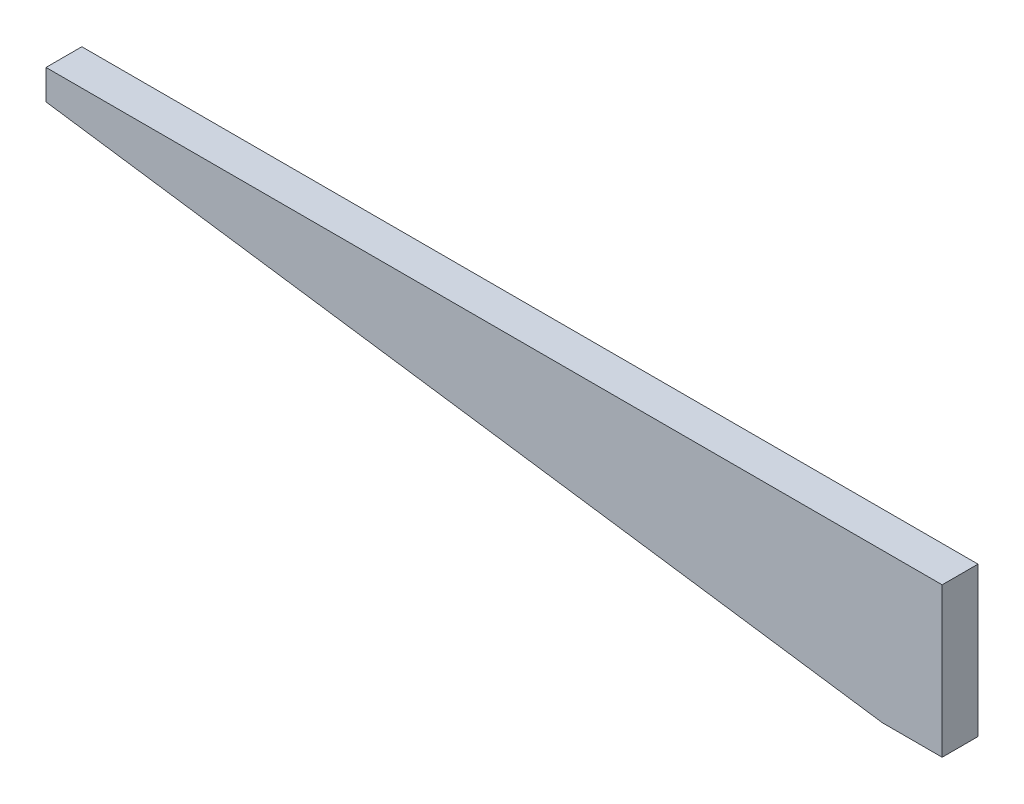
from build123d import *

# Parameters (mm, degrees)
EXTRUSION1_DEPTH = 3


with BuildPart() as part:
    # Esquisse1 → Extrusion1 (new, symmetric)
    with BuildSketch(Plane.XY):
        Polygon((0, 0), (0, 25), (-150, 25), (-150, 20), (-10, 0), align=None)
    extrude(amount=EXTRUSION1_DEPTH, both=True)


solid = part.part
